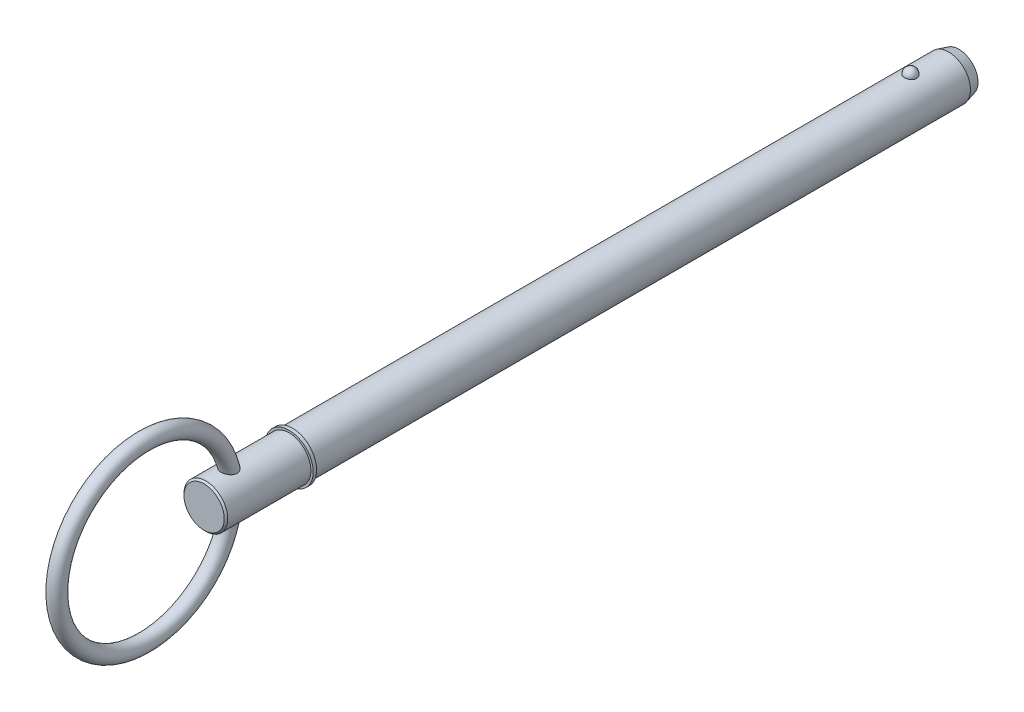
ISO-10303-21;
HEADER;
FILE_DESCRIPTION(('STEP AP214'),'2;1');
FILE_NAME('part.step','',(''),(''),'','','');
FILE_SCHEMA(('AUTOMOTIVE_DESIGN { 1 0 10303 214 1 1 1 1 }'));
ENDSEC;
DATA;
#1=APPLICATION_CONTEXT('core data for automotive mechanical design processes');
#2=APPLICATION_PROTOCOL_DEFINITION('international standard','automotive_design',2000,#1);
#3=PRODUCT_CONTEXT('',#1,'mechanical');
#4=PRODUCT('Part','Part','',(#3));
#5=PRODUCT_RELATED_PRODUCT_CATEGORY('part','',(#4));
#6=PRODUCT_DEFINITION_FORMATION('','',#4);
#7=PRODUCT_DEFINITION_CONTEXT('part definition',#1,'design');
#8=PRODUCT_DEFINITION('design','',#6,#7);
#9=PRODUCT_DEFINITION_SHAPE('','',#8);
#10=(LENGTH_UNIT() NAMED_UNIT(*) SI_UNIT(.MILLI.,.METRE.));
#11=(NAMED_UNIT(*) PLANE_ANGLE_UNIT() SI_UNIT($,.RADIAN.));
#12=(NAMED_UNIT(*) SI_UNIT($,.STERADIAN.) SOLID_ANGLE_UNIT());
#13=UNCERTAINTY_MEASURE_WITH_UNIT(LENGTH_MEASURE(1.E-05),#10,'distance_accuracy_value','');
#14=(GEOMETRIC_REPRESENTATION_CONTEXT(3) GLOBAL_UNCERTAINTY_ASSIGNED_CONTEXT((#13)) GLOBAL_UNIT_ASSIGNED_CONTEXT((#10,
#11,#12)) REPRESENTATION_CONTEXT('',''));
#15=CARTESIAN_POINT('',(0.,0.,0.));
#16=DIRECTION('',(0.,0.,1.));
#17=DIRECTION('',(1.,0.,0.));
#18=AXIS2_PLACEMENT_3D('',#15,#16,#17);
#19=CARTESIAN_POINT('',(0.,0.,177.8));
#20=DIRECTION('',(0.,0.,-1.));
#21=DIRECTION('',(-1.,0.,0.));
#22=AXIS2_PLACEMENT_3D('',#19,#20,#21);
#23=CYLINDRICAL_SURFACE('',#22,6.35);
#24=CARTESIAN_POINT('',(1.76243001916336,6.10051968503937,-1.78));
#25=CARTESIAN_POINT('',(1.76242835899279,6.10052111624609,-1.68050311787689));
#26=CARTESIAN_POINT('',(1.75431593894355,6.1028816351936,-1.58098521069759));
#27=CARTESIAN_POINT('',(1.72206027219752,6.11206037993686,-1.38476972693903));
#28=CARTESIAN_POINT('',(1.69791106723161,6.11888026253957,-1.28807321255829));
#29=CARTESIAN_POINT('',(1.63419596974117,6.13620287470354,-1.10029899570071));
#30=CARTESIAN_POINT('',(1.59463684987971,6.14670398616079,-1.00921884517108));
#31=CARTESIAN_POINT('',(1.50108569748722,6.17021534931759,-0.83516140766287));
#32=CARTESIAN_POINT('',(1.44709398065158,6.18322554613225,-0.752183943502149));
#33=CARTESIAN_POINT('',(1.32572431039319,6.21038081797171,-0.596209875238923));
#34=CARTESIAN_POINT('',(1.2582815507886,6.22453118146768,-0.523264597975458));
#35=CARTESIAN_POINT('',(1.11191624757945,6.25233390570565,-0.389855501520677));
#36=CARTESIAN_POINT('',(1.03299369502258,6.26598626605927,-0.329391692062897));
#37=CARTESIAN_POINT('',(0.866022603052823,6.29123226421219,-0.222793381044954));
#38=CARTESIAN_POINT('',(0.778000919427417,6.30283170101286,-0.176618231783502));
#39=CARTESIAN_POINT('',(0.595108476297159,6.32272058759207,-0.0996905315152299));
#40=CARTESIAN_POINT('',(0.500238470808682,6.33101040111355,-0.0689362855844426));
#41=CARTESIAN_POINT('',(0.308164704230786,6.34323464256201,-0.0241595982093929));
#42=CARTESIAN_POINT('',(0.211033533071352,6.34724467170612,-0.00984637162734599));
#43=CARTESIAN_POINT('',(0.0156629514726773,6.3507318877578,0.00262058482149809));
#44=CARTESIAN_POINT('',(-0.0825763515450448,6.35020951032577,0.000775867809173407));
#45=CARTESIAN_POINT('',(-0.275890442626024,6.34473055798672,-0.0188727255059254));
#46=CARTESIAN_POINT('',(-0.370990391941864,6.3398374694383,-0.0364481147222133));
#47=CARTESIAN_POINT('',(-0.556805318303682,6.32622723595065,-0.0867447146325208));
#48=CARTESIAN_POINT('',(-0.64752021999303,6.31751002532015,-0.119466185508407));
#49=CARTESIAN_POINT('',(-0.82260655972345,6.29711353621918,-0.199386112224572));
#50=CARTESIAN_POINT('',(-0.906938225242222,6.28541739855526,-0.246667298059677));
#51=CARTESIAN_POINT('',(-1.06646479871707,6.26032612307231,-0.35436574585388));
#52=CARTESIAN_POINT('',(-1.14165877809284,6.24693081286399,-0.414784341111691));
#53=CARTESIAN_POINT('',(-1.2823514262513,6.21959142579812,-0.548435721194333));
#54=CARTESIAN_POINT('',(-1.34763761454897,6.2056417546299,-0.621891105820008));
#55=CARTESIAN_POINT('',(-1.4651153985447,6.1789624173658,-0.778815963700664));
#56=CARTESIAN_POINT('',(-1.51730606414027,6.16623283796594,-0.862286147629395));
#57=CARTESIAN_POINT('',(-1.60782211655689,6.14325839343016,-1.03799158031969));
#58=CARTESIAN_POINT('',(-1.64598111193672,6.13304379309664,-1.13031660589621));
#59=CARTESIAN_POINT('',(-1.70661885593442,6.11644899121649,-1.32030667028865));
#60=CARTESIAN_POINT('',(-1.72909805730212,6.11006867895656,-1.41797155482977));
#61=CARTESIAN_POINT('',(-1.75775019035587,6.1018881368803,-1.61543246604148));
#62=CARTESIAN_POINT('',(-1.76399136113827,6.10006874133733,-1.71521779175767));
#63=CARTESIAN_POINT('',(-1.76020715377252,6.10116172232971,-1.91445126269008));
#64=CARTESIAN_POINT('',(-1.750182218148,6.10407397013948,-2.01389941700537));
#65=CARTESIAN_POINT('',(-1.71421005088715,6.11427232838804,-2.20912106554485));
#66=CARTESIAN_POINT('',(-1.68834262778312,6.12153651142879,-2.30491043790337));
#67=CARTESIAN_POINT('',(-1.62139543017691,6.1396067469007,-2.49066180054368));
#68=CARTESIAN_POINT('',(-1.5803150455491,6.15041294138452,-2.58062355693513));
#69=CARTESIAN_POINT('',(-1.48369112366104,6.17443456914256,-2.75271428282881));
#70=CARTESIAN_POINT('',(-1.42806998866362,6.18766281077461,-2.83479789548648));
#71=CARTESIAN_POINT('',(-1.30386620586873,6.21501934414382,-2.98832532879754));
#72=CARTESIAN_POINT('',(-1.23528306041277,6.22914767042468,-3.05976874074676));
#73=CARTESIAN_POINT('',(-1.08663999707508,6.25679135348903,-3.19029656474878));
#74=CARTESIAN_POINT('',(-1.00653826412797,6.27030422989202,-3.24933392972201));
#75=CARTESIAN_POINT('',(-0.837212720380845,6.29514770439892,-3.35304657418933));
#76=CARTESIAN_POINT('',(-0.747989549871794,6.30647845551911,-3.39772286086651));
#77=CARTESIAN_POINT('',(-0.564098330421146,6.32556124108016,-3.47096393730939));
#78=CARTESIAN_POINT('',(-0.469512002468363,6.33335611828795,-3.49972259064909));
#79=CARTESIAN_POINT('',(-0.276633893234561,6.34470628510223,-3.54113722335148));
#80=CARTESIAN_POINT('',(-0.17834256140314,6.34826208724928,-3.55379514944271));
#81=CARTESIAN_POINT('',(0.0171660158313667,6.35071525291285,-3.56255473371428));
#82=CARTESIAN_POINT('',(0.114368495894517,6.34969931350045,-3.55896450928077));
#83=CARTESIAN_POINT('',(0.306746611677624,6.34331695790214,-3.53603383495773));
#84=CARTESIAN_POINT('',(0.401922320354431,6.33795069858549,-3.51669395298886));
#85=CARTESIAN_POINT('',(0.587203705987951,6.32347219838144,-3.4629173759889));
#86=CARTESIAN_POINT('',(0.677327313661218,6.31437430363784,-3.42853846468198));
#87=CARTESIAN_POINT('',(0.850462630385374,6.29339543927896,-3.34564128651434));
#88=CARTESIAN_POINT('',(0.933473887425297,6.2815142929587,-3.29712212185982));
#89=CARTESIAN_POINT('',(1.09144542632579,6.25601750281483,-3.18638742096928));
#90=CARTESIAN_POINT('',(1.16626195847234,6.24237795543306,-3.12397237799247));
#91=CARTESIAN_POINT('',(1.30444862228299,6.21497285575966,-2.98755865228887));
#92=CARTESIAN_POINT('',(1.36781676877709,6.20120728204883,-2.91355796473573));
#93=CARTESIAN_POINT('',(1.48252779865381,6.17479923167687,-2.75456133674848));
#94=CARTESIAN_POINT('',(1.53364167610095,6.16218052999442,-2.66939613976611));
#95=CARTESIAN_POINT('',(1.62109397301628,6.13975602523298,-2.49147502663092));
#96=CARTESIAN_POINT('',(1.657437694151,6.12994921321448,-2.39872184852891));
#97=CARTESIAN_POINT('',(1.71127844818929,6.11512175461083,-2.21887622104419));
#98=CARTESIAN_POINT('',(1.73042646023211,6.10968903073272,-2.13230770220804));
#99=CARTESIAN_POINT('',(1.75600284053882,6.10238739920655,-1.95716498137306));
#100=CARTESIAN_POINT('',(1.76243149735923,6.10051841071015,-1.86859082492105));
#101=CARTESIAN_POINT('',(1.76243001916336,6.10051968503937,-1.78));
#102=B_SPLINE_CURVE_WITH_KNOTS('',3,(#24,#25,#26,#27,#28,#29,#30,#31,#32,#33,#34,#35,#36,#37,
#38,#39,#40,#41,#42,#43,#44,#45,#46,#47,#48,#49,#50,#51,#52,#53,#54,#55,#56,#57,#58,#59,#60,#61,
#62,#63,#64,#65,#66,#67,#68,#69,#70,#71,#72,#73,#74,#75,#76,#77,#78,#79,#80,#81,#82,#83,#84,#85,
#86,#87,#88,#89,#90,#91,#92,#93,#94,#95,#96,#97,#98,#99,#100,#101),.UNSPECIFIED.,.T.,.F.,(4,2,2,
2,2,2,2,2,2,2,2,2,2,2,2,2,2,2,2,2,2,2,2,2,2,2,2,2,2,2,2,2,2,2,2,2,2,2,4),(0.,0.298172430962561,
0.596455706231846,0.894608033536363,1.19275383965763,1.49237238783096,1.79199116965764,
2.09074960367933,2.38947519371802,2.68283180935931,2.97616022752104,3.26529599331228,
3.55443672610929,3.84525169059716,4.13609618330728,4.43249276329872,4.72891038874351,
5.02873757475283,5.32855610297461,5.62711261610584,5.92566100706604,6.22271765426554,
6.51978621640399,6.81847366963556,7.11717259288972,7.41698459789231,7.71677557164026,
8.01283014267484,8.30884891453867,8.59927798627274,8.88969658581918,9.17900899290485,
9.46833977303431,9.76212836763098,10.0559678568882,10.3549321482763,10.6537890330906,
10.9192841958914,11.1847733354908),.UNSPECIFIED.);
#103=CARTESIAN_POINT('',(1.76243001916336,6.10051968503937,-1.78));
#104=VERTEX_POINT('',#103);
#105=EDGE_CURVE('E100',#104,#104,#102,.T.);
#106=ORIENTED_EDGE('',*,*,#105,.T.);
#107=EDGE_LOOP('',(#106));
#108=FACE_BOUND('',#107,.T.);
#109=CARTESIAN_POINT('',(0.,0.,-12.8799999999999));
#110=DIRECTION('',(0.,0.,-1.));
#111=DIRECTION('',(-1.,0.,0.));
#112=AXIS2_PLACEMENT_3D('',#109,#110,#111);
#113=CIRCLE('',#112,6.35);
#114=CARTESIAN_POINT('',(-6.35,0.,-12.8799999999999));
#115=VERTEX_POINT('',#114);
#116=EDGE_CURVE('E107',#115,#115,#113,.F.);
#117=ORIENTED_EDGE('',*,*,#116,.T.);
#118=EDGE_LOOP('',(#117));
#119=FACE_BOUND('',#118,.T.);
#120=CARTESIAN_POINT('',(0.,0.,177.8));
#121=DIRECTION('',(0.,0.,1.));
#122=DIRECTION('',(1.,0.,0.));
#123=AXIS2_PLACEMENT_3D('',#120,#121,#122);
#124=CIRCLE('',#123,6.35);
#125=CARTESIAN_POINT('',(6.35,0.,177.8));
#126=VERTEX_POINT('',#125);
#127=EDGE_CURVE('E105',#126,#126,#124,.T.);
#128=ORIENTED_EDGE('',*,*,#127,.F.);
#129=EDGE_LOOP('',(#128));
#130=FACE_BOUND('',#129,.T.);
#131=ADVANCED_FACE('F39',(#108,#119,#130),#23,.T.);
#132=CARTESIAN_POINT('',(0.,0.,-15.88));
#133=DIRECTION('',(0.,0.,-1.));
#134=DIRECTION('',(-1.,0.,0.));
#135=AXIS2_PLACEMENT_3D('',#132,#133,#134);
#136=PLANE('',#135);
#137=CARTESIAN_POINT('',(0.,0.,-15.88));
#138=DIRECTION('',(0.,0.,-1.));
#139=DIRECTION('',(-1.,0.,0.));
#140=AXIS2_PLACEMENT_3D('',#137,#138,#139);
#141=CIRCLE('',#140,5.54615242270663);
#142=CARTESIAN_POINT('',(-5.54615242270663,0.,-15.88));
#143=VERTEX_POINT('',#142);
#144=EDGE_CURVE('E141',#143,#143,#141,.T.);
#145=ORIENTED_EDGE('',*,*,#144,.T.);
#146=EDGE_LOOP('',(#145));
#147=FACE_BOUND('',#146,.T.);
#148=ADVANCED_FACE('F86',(#147),#136,.T.);
#149=CARTESIAN_POINT('',(0.,0.,-15.88));
#150=DIRECTION('',(0.,0.,1.));
#151=DIRECTION('',(1.,0.,0.));
#152=AXIS2_PLACEMENT_3D('',#149,#150,#151);
#153=CONICAL_SURFACE('',#152,5.54615242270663,0.261799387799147);
#154=ORIENTED_EDGE('',*,*,#116,.F.);
#155=EDGE_LOOP('',(#154));
#156=FACE_BOUND('',#155,.T.);
#157=ORIENTED_EDGE('',*,*,#144,.F.);
#158=EDGE_LOOP('',(#157));
#159=FACE_BOUND('',#158,.T.);
#160=ADVANCED_FACE('F92',(#156,#159),#153,.T.);
#161=CARTESIAN_POINT('',(0.,6.35,-1.78));
#162=DIRECTION('',(0.,1.,0.));
#163=DIRECTION('',(0.,0.,-1.));
#164=AXIS2_PLACEMENT_3D('',#161,#162,#163);
#165=SPHERICAL_SURFACE('',#164,1.78);
#166=ORIENTED_EDGE('',*,*,#105,.F.);
#167=EDGE_LOOP('',(#166));
#168=FACE_BOUND('',#167,.T.);
#169=ADVANCED_FACE('F110',(#168),#165,.T.);
#170=CARTESIAN_POINT('',(0.,0.,177.8));
#171=DIRECTION('',(0.,0.,-1.));
#172=DIRECTION('',(-1.,0.,0.));
#173=AXIS2_PLACEMENT_3D('',#170,#171,#172);
#174=PLANE('',#173);
#175=ORIENTED_EDGE('',*,*,#127,.T.);
#176=EDGE_LOOP('',(#175));
#177=FACE_BOUND('',#176,.T.);
#178=CARTESIAN_POINT('',(0.,0.,177.8));
#179=DIRECTION('',(0.,0.,-1.));
#180=DIRECTION('',(-1.,0.,0.));
#181=AXIS2_PLACEMENT_3D('',#178,#179,#180);
#182=CIRCLE('',#181,7.);
#183=CARTESIAN_POINT('',(-7.,0.,177.8));
#184=VERTEX_POINT('',#183);
#185=EDGE_CURVE('E106',#184,#184,#182,.T.);
#186=ORIENTED_EDGE('',*,*,#185,.T.);
#187=EDGE_LOOP('',(#186));
#188=FACE_BOUND('',#187,.T.);
#189=ADVANCED_FACE('F114',(#177,#188),#174,.T.);
#190=CARTESIAN_POINT('',(0.,0.,33.7287874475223));
#191=DIRECTION('',(0.,0.,-1.));
#192=DIRECTION('',(-1.,0.,0.));
#193=AXIS2_PLACEMENT_3D('',#190,#191,#192);
#194=CYLINDRICAL_SURFACE('',#193,7.);
#195=CARTESIAN_POINT('',(0.,0.,178.8));
#196=DIRECTION('',(0.,0.,-1.));
#197=DIRECTION('',(-1.,0.,0.));
#198=AXIS2_PLACEMENT_3D('',#195,#196,#197);
#199=CIRCLE('',#198,7.);
#200=CARTESIAN_POINT('',(-7.,0.,178.8));
#201=VERTEX_POINT('',#200);
#202=EDGE_CURVE('E131',#201,#201,#199,.T.);
#203=ORIENTED_EDGE('',*,*,#202,.T.);
#204=EDGE_LOOP('',(#203));
#205=FACE_BOUND('',#204,.T.);
#206=ORIENTED_EDGE('',*,*,#185,.F.);
#207=EDGE_LOOP('',(#206));
#208=FACE_BOUND('',#207,.T.);
#209=ADVANCED_FACE('F118',(#205,#208),#194,.T.);
#210=CARTESIAN_POINT('',(0.,7.,178.8));
#211=DIRECTION('',(0.,0.,1.));
#212=DIRECTION('',(1.,0.,0.));
#213=AXIS2_PLACEMENT_3D('',#210,#211,#212);
#214=PLANE('',#213);
#215=CARTESIAN_POINT('',(0.,0.,178.8));
#216=DIRECTION('',(0.,0.,1.));
#217=DIRECTION('',(1.,0.,0.));
#218=AXIS2_PLACEMENT_3D('',#215,#216,#217);
#219=CIRCLE('',#218,6.35);
#220=CARTESIAN_POINT('',(6.35,0.,178.8));
#221=VERTEX_POINT('',#220);
#222=EDGE_CURVE('E109',#221,#221,#219,.T.);
#223=ORIENTED_EDGE('',*,*,#222,.F.);
#224=EDGE_LOOP('',(#223));
#225=FACE_BOUND('',#224,.T.);
#226=ORIENTED_EDGE('',*,*,#202,.F.);
#227=EDGE_LOOP('',(#226));
#228=FACE_BOUND('',#227,.T.);
#229=ADVANCED_FACE('F83',(#225,#228),#214,.T.);
#230=CARTESIAN_POINT('',(0.,0.,203.5));
#231=DIRECTION('',(0.,0.,-1.));
#232=DIRECTION('',(-1.,0.,0.));
#233=AXIS2_PLACEMENT_3D('',#230,#231,#232);
#234=CYLINDRICAL_SURFACE('',#233,6.35);
#235=CARTESIAN_POINT('',(-1.08120660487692,-6.25727514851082,194.25158117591));
#236=CARTESIAN_POINT('',(-0.970724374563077,-6.27636409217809,194.193879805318));
#237=CARTESIAN_POINT('',(-0.855136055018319,-6.29329984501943,194.145219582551));
#238=CARTESIAN_POINT('',(-0.616958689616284,-6.32109419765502,194.06705594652));
#239=CARTESIAN_POINT('',(-0.494369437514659,-6.3319526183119,194.03755309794));
#240=CARTESIAN_POINT('',(-0.245606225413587,-6.34647141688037,193.998367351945));
#241=CARTESIAN_POINT('',(-0.119431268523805,-6.35012977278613,193.988690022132));
#242=CARTESIAN_POINT('',(0.132849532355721,-6.34986313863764,193.989400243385));
#243=CARTESIAN_POINT('',(0.258955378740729,-6.34593843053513,193.999787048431));
#244=CARTESIAN_POINT('',(0.506912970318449,-6.33094785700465,194.040285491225));
#245=CARTESIAN_POINT('',(0.628781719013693,-6.31991516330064,194.070305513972));
#246=CARTESIAN_POINT('',(0.865486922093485,-6.29187143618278,194.149308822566));
#247=CARTESIAN_POINT('',(0.980322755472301,-6.27485987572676,194.198293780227));
#248=CARTESIAN_POINT('',(1.20050616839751,-6.23649440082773,194.314540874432));
#249=CARTESIAN_POINT('',(1.30578867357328,-6.2151135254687,194.381917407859));
#250=CARTESIAN_POINT('',(1.50311440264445,-6.17036440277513,194.533359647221));
#251=CARTESIAN_POINT('',(1.5951571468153,-6.14699608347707,194.617425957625));
#252=CARTESIAN_POINT('',(1.76326863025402,-6.10090072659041,194.800247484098));
#253=CARTESIAN_POINT('',(1.83935482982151,-6.07817301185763,194.898986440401));
#254=CARTESIAN_POINT('',(1.97338559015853,-6.03599268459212,195.108703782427));
#255=CARTESIAN_POINT('',(2.03133638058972,-6.01653894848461,195.219677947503));
#256=CARTESIAN_POINT('',(2.1259120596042,-5.98376466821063,195.447018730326));
#257=CARTESIAN_POINT('',(2.16315310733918,-5.97026970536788,195.563104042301));
#258=CARTESIAN_POINT('',(2.21830650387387,-5.94999923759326,195.800318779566));
#259=CARTESIAN_POINT('',(2.2362211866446,-5.94322292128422,195.921447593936));
#260=CARTESIAN_POINT('',(2.25273772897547,-5.93698111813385,196.163281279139));
#261=CARTESIAN_POINT('',(2.25163224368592,-5.93740484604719,196.283964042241));
#262=CARTESIAN_POINT('',(2.23167546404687,-5.94493297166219,196.523620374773));
#263=CARTESIAN_POINT('',(2.21281883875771,-5.9520393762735,196.642593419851));
#264=CARTESIAN_POINT('',(2.15679576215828,-5.97257680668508,196.883836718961));
#265=CARTESIAN_POINT('',(2.1185113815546,-5.98639144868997,197.00581287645));
#266=CARTESIAN_POINT('',(2.02470263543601,-6.01876484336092,197.242284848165));
#267=CARTESIAN_POINT('',(1.96916879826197,-6.03732620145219,197.356776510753));
#268=CARTESIAN_POINT('',(1.83526629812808,-6.07945247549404,197.587995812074));
#269=CARTESIAN_POINT('',(1.75507038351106,-6.10334207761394,197.703611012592));
#270=CARTESIAN_POINT('',(1.5765788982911,-6.15186551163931,197.919894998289));
#271=CARTESIAN_POINT('',(1.47827192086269,-6.17649980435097,198.020554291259));
#272=CARTESIAN_POINT('',(1.26306696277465,-6.22410762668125,198.205023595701));
#273=CARTESIAN_POINT('',(1.14585214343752,-6.2470408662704,198.288478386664));
#274=CARTESIAN_POINT('',(0.896825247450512,-6.28760987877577,198.431400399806));
#275=CARTESIAN_POINT('',(0.765036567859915,-6.30525397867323,198.490905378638));
#276=CARTESIAN_POINT('',(0.509454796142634,-6.330648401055,198.575263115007));
#277=CARTESIAN_POINT('',(0.386964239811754,-6.33940909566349,198.603695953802));
#278=CARTESIAN_POINT('',(0.200813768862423,-6.3471308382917,198.628680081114));
#279=CARTESIAN_POINT('',(0.138353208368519,-6.34880140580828,198.634063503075));
#280=CARTESIAN_POINT('',(0.0131841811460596,-6.35029448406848,198.63887386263));
#281=CARTESIAN_POINT('',(-0.049524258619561,-6.35011719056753,198.638301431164));
#282=CARTESIAN_POINT('',(-0.219860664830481,-6.34710452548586,198.628597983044));
#283=CARTESIAN_POINT('',(-0.327176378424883,-6.34243953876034,198.613576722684));
#284=CARTESIAN_POINT('',(-0.537619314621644,-6.32808248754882,198.566673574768));
#285=CARTESIAN_POINT('',(-0.640746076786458,-6.31838987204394,198.534789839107));
#286=CARTESIAN_POINT('',(-0.84179516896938,-6.29478075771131,198.455337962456));
#287=CARTESIAN_POINT('',(-0.939631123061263,-6.28081033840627,198.40756888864));
#288=CARTESIAN_POINT('',(-1.12690564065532,-6.2499288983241,198.298513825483));
#289=CARTESIAN_POINT('',(-1.21634109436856,-6.2330167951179,198.237222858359));
#290=CARTESIAN_POINT('',(-1.39713031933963,-6.19517308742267,198.094039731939));
#291=CARTESIAN_POINT('',(-1.48711596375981,-6.17400700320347,198.010483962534));
#292=CARTESIAN_POINT('',(-1.65373642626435,-6.13148145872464,197.830996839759));
#293=CARTESIAN_POINT('',(-1.73036130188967,-6.11012186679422,197.73505636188));
#294=CARTESIAN_POINT('',(-1.87908981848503,-6.0661652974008,197.518620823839));
#295=CARTESIAN_POINT('',(-1.94902044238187,-6.04382072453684,197.396572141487));
#296=CARTESIAN_POINT('',(-2.06849605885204,-6.00398244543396,197.142070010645));
#297=CARTESIAN_POINT('',(-2.11803457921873,-5.98649027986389,197.009613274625));
#298=CARTESIAN_POINT('',(-2.19551930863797,-5.95851933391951,196.734593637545));
#299=CARTESIAN_POINT('',(-2.22297667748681,-5.94819998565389,196.591874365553));
#300=CARTESIAN_POINT('',(-2.25222139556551,-5.93719450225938,196.303480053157));
#301=CARTESIAN_POINT('',(-2.25403508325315,-5.93649848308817,196.157808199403));
#302=CARTESIAN_POINT('',(-2.23178480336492,-5.94489150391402,195.883804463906));
#303=CARTESIAN_POINT('',(-2.21035650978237,-5.95298402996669,195.755226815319));
#304=CARTESIAN_POINT('',(-2.14565882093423,-5.97660650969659,195.50440891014));
#305=CARTESIAN_POINT('',(-2.10239634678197,-5.99213410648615,195.382166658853));
#306=CARTESIAN_POINT('',(-1.99913159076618,-6.02732890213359,195.156747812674));
#307=CARTESIAN_POINT('',(-1.94060271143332,-6.0466053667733,195.052829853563));
#308=CARTESIAN_POINT('',(-1.80736340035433,-6.0877569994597,194.856534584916));
#309=CARTESIAN_POINT('',(-1.73265259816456,-6.10963222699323,194.764157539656));
#310=CARTESIAN_POINT('',(-1.56865095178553,-6.15378470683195,194.592603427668));
#311=CARTESIAN_POINT('',(-1.47928749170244,-6.17606344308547,194.513496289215));
#312=CARTESIAN_POINT('',(-1.28858731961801,-6.21864788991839,194.370675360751));
#313=CARTESIAN_POINT('',(-1.18724893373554,-6.23895332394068,194.306963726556));
#314=CARTESIAN_POINT('',(-1.08120660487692,-6.25727514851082,194.25158117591));
#315=B_SPLINE_CURVE_WITH_KNOTS('',3,(#235,#236,#237,#238,#239,#240,#241,#242,#243,#244,#245,
#246,#247,#248,#249,#250,#251,#252,#253,#254,#255,#256,#257,#258,#259,#260,#261,#262,#263,#264,
#265,#266,#267,#268,#269,#270,#271,#272,#273,#274,#275,#276,#277,#278,#279,#280,#281,#282,#283,
#284,#285,#286,#287,#288,#289,#290,#291,#292,#293,#294,#295,#296,#297,#298,#299,#300,#301,#302,
#303,#304,#305,#306,#307,#308,#309,#310,#311,#312,#313,#314),.UNSPECIFIED.,.T.,.F.,(4,2,2,2,2,2,
2,2,2,2,2,2,2,2,2,2,2,2,2,2,2,2,2,2,2,2,2,2,2,2,2,2,2,2,2,2,2,2,2,4),(0.,0.377861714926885,
0.755734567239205,1.13371352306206,1.51167842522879,1.88789208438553,2.26413891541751,
2.64278156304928,3.02143792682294,3.3996777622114,3.77778752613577,4.14394628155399,
4.51006081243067,4.87054720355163,5.23114188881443,5.61534494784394,5.99975934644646,
6.42600522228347,6.8525204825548,7.28711365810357,7.72101899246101,8.09666132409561,
8.28452949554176,8.47237776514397,8.7960795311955,9.11981678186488,9.44781545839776,
9.77593508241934,10.1483085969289,10.5209580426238,10.9463240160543,11.3718248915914,
11.8065046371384,12.240737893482,12.6304236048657,13.0199858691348,13.3807583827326,
13.7415391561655,14.104165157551,14.4668419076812),.UNSPECIFIED.);
#316=CARTESIAN_POINT('',(-1.08120660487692,-6.25727514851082,194.25158117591));
#317=VERTEX_POINT('',#316);
#318=EDGE_CURVE('E10',#317,#317,#315,.T.);
#319=ORIENTED_EDGE('',*,*,#318,.F.);
#320=EDGE_LOOP('',(#319));
#321=FACE_BOUND('',#320,.T.);
#322=CARTESIAN_POINT('',(-1.08120660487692,6.25727514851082,194.25158117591));
#323=CARTESIAN_POINT('',(-1.19093168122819,6.23831652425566,194.308887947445));
#324=CARTESIAN_POINT('',(-1.29562751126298,6.21723224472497,194.375116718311));
#325=CARTESIAN_POINT('',(-1.49211272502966,6.17302620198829,194.524020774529));
#326=CARTESIAN_POINT('',(-1.58390200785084,6.14990442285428,194.606696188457));
#327=CARTESIAN_POINT('',(-1.75209695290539,6.10411985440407,194.786777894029));
#328=CARTESIAN_POINT('',(-1.82848346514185,6.08145766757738,194.884202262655));
#329=CARTESIAN_POINT('',(-1.96346259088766,6.0392331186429,195.091273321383));
#330=CARTESIAN_POINT('',(-2.02206050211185,6.01966983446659,195.200916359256));
#331=CARTESIAN_POINT('',(-2.11860444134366,5.9863659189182,195.426564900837));
#332=CARTESIAN_POINT('',(-2.15701637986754,5.97249571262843,195.542351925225));
#333=CARTESIAN_POINT('',(-2.21449304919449,5.95142584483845,195.779191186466));
#334=CARTESIAN_POINT('',(-2.23356015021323,5.94422536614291,195.900242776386));
#335=CARTESIAN_POINT('',(-2.25228141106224,5.93715610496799,196.141944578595));
#336=CARTESIAN_POINT('',(-2.25225786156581,5.93716560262,196.262567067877));
#337=CARTESIAN_POINT('',(-2.2344206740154,5.94389982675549,196.502277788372));
#338=CARTESIAN_POINT('',(-2.21660184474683,5.95062651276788,196.621365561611));
#339=CARTESIAN_POINT('',(-2.16272689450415,5.97042554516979,196.862705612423));
#340=CARTESIAN_POINT('',(-2.12559286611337,5.98387086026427,196.984684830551));
#341=CARTESIAN_POINT('',(-2.03409944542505,6.01558578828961,197.221342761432));
#342=CARTESIAN_POINT('',(-1.97973080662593,6.03385799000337,197.336017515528));
#343=CARTESIAN_POINT('',(-1.84828023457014,6.07549301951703,197.567865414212));
#344=CARTESIAN_POINT('',(-1.76936622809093,6.09919386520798,197.683943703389));
#345=CARTESIAN_POINT('',(-1.59344783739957,6.14749881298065,197.901420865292));
#346=CARTESIAN_POINT('',(-1.49643151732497,6.17210350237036,198.002809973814));
#347=CARTESIAN_POINT('',(-1.28333318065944,6.21994692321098,198.189508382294));
#348=CARTESIAN_POINT('',(-1.1668572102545,6.24314005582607,198.2743845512));
#349=CARTESIAN_POINT('',(-0.919062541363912,6.2843871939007,198.42034404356));
#350=CARTESIAN_POINT('',(-0.78776676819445,6.30244898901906,198.481463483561));
#351=CARTESIAN_POINT('',(-0.532335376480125,6.32876911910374,198.56911129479));
#352=CARTESIAN_POINT('',(-0.40951692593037,6.33800211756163,198.599123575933));
#353=CARTESIAN_POINT('',(-0.222636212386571,6.34640533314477,198.626338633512));
#354=CARTESIAN_POINT('',(-0.159893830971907,6.34829860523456,198.632442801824));
#355=CARTESIAN_POINT('',(-0.0340877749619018,6.35021985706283,198.63863417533));
#356=CARTESIAN_POINT('',(0.0289758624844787,6.35024804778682,198.63872206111));
#357=CARTESIAN_POINT('',(0.200008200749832,6.34776620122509,198.630732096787));
#358=CARTESIAN_POINT('',(0.307730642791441,6.34342046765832,198.61675007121));
#359=CARTESIAN_POINT('',(0.51913450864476,6.32963338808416,198.571765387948));
#360=CARTESIAN_POINT('',(0.622815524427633,6.3201915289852,198.540761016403));
#361=CARTESIAN_POINT('',(0.824580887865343,6.2970603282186,198.463086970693));
#362=CARTESIAN_POINT('',(0.922611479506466,6.28333629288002,198.416289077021));
#363=CARTESIAN_POINT('',(1.11039970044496,6.2528858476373,198.309122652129));
#364=CARTESIAN_POINT('',(1.20015435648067,6.23615836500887,198.248749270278));
#365=CARTESIAN_POINT('',(1.38155818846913,6.19866747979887,198.10760245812));
#366=CARTESIAN_POINT('',(1.4718764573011,6.17766310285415,198.025184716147));
#367=CARTESIAN_POINT('',(1.63933626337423,6.13535258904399,197.847946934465));
#368=CARTESIAN_POINT('',(1.71646809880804,6.11404624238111,197.753117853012));
#369=CARTESIAN_POINT('',(1.86660460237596,6.07002946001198,197.538851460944));
#370=CARTESIAN_POINT('',(1.93743710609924,6.04755477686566,197.417834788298));
#371=CARTESIAN_POINT('',(2.05894300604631,6.00727604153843,197.165280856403));
#372=CARTESIAN_POINT('',(2.10960917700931,5.98947366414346,197.033739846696));
#373=CARTESIAN_POINT('',(2.18982014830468,5.96062717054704,196.759758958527));
#374=CARTESIAN_POINT('',(2.21877575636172,5.94977267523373,196.617123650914));
#375=CARTESIAN_POINT('',(2.25104759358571,5.93764416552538,196.328595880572));
#376=CARTESIAN_POINT('',(2.25438985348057,5.93636042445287,196.182706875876));
#377=CARTESIAN_POINT('',(2.23498011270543,5.94368858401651,195.907731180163));
#378=CARTESIAN_POINT('',(2.21482640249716,5.95131530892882,195.778434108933));
#379=CARTESIAN_POINT('',(2.15248760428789,5.97414352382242,195.525969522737));
#380=CARTESIAN_POINT('',(2.11031020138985,5.98934237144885,195.402799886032));
#381=CARTESIAN_POINT('',(2.00904610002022,6.02402214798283,195.175783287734));
#382=CARTESIAN_POINT('',(1.95150192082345,6.04308594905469,195.071178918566));
#383=CARTESIAN_POINT('',(1.82009972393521,6.08395083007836,194.873382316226));
#384=CARTESIAN_POINT('',(1.74624088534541,6.10575204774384,194.780190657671));
#385=CARTESIAN_POINT('',(1.58309476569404,6.15008431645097,194.606164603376));
#386=CARTESIAN_POINT('',(1.49360904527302,6.17262128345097,194.525518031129));
#387=CARTESIAN_POINT('',(1.30231515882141,6.21579297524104,194.379836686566));
#388=CARTESIAN_POINT('',(1.20050521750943,6.23642742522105,194.31480416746));
#389=CARTESIAN_POINT('',(0.983786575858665,6.27432316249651,194.1998596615));
#390=CARTESIAN_POINT('',(0.868563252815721,6.29145558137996,194.150497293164));
#391=CARTESIAN_POINT('',(0.630994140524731,6.31970327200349,194.070885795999));
#392=CARTESIAN_POINT('',(0.508648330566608,6.33081852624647,194.040636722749));
#393=CARTESIAN_POINT('',(0.259933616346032,6.34590352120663,193.999879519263));
#394=CARTESIAN_POINT('',(0.133554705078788,6.34985380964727,193.989425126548));
#395=CARTESIAN_POINT('',(-0.119270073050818,6.35013815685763,193.988667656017));
#396=CARTESIAN_POINT('',(-0.245715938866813,6.34647233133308,193.998364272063));
#397=CARTESIAN_POINT('',(-0.494670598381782,6.33192772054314,194.037620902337));
#398=CARTESIAN_POINT('',(-0.617189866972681,6.3210701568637,194.067122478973));
#399=CARTESIAN_POINT('',(-0.855240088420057,6.29328476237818,194.145263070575));
#400=CARTESIAN_POINT('',(-0.970770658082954,6.27635659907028,194.193903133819));
#401=CARTESIAN_POINT('',(-1.08120660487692,6.25727514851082,194.25158117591));
#402=B_SPLINE_CURVE_WITH_KNOTS('',3,(#322,#323,#324,#325,#326,#327,#328,#329,#330,#331,#332,
#333,#334,#335,#336,#337,#338,#339,#340,#341,#342,#343,#344,#345,#346,#347,#348,#349,#350,#351,
#352,#353,#354,#355,#356,#357,#358,#359,#360,#361,#362,#363,#364,#365,#366,#367,#368,#369,#370,
#371,#372,#373,#374,#375,#376,#377,#378,#379,#380,#381,#382,#383,#384,#385,#386,#387,#388,#389,
#390,#391,#392,#393,#394,#395,#396,#397,#398,#399,#400,#401),.UNSPECIFIED.,.T.,.F.,(4,2,2,2,2,2,
2,2,2,2,2,2,2,2,2,2,2,2,2,2,2,2,2,2,2,2,2,2,2,2,2,2,2,2,2,2,2,2,2,4),(0.,0.375258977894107,
0.750520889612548,1.1262465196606,1.50186014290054,1.86837438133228,2.23484370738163,
2.59512638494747,2.95551419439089,3.33859924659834,3.7218901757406,4.14704029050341,
4.57247172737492,5.00788576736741,5.44263524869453,5.82040093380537,6.00932292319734,
6.19822354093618,6.52266071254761,6.84713055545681,7.17430063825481,7.50158780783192,
7.87233275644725,8.24334931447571,8.66748794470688,9.09177840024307,9.52720369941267,
9.96218641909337,10.3532895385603,10.7442562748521,11.1052784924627,11.4663188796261,
11.8323306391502,12.1983951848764,12.5761580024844,12.9539219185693,13.3327099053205,
13.7114921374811,14.0891615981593,14.4668517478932),.UNSPECIFIED.);
#403=CARTESIAN_POINT('',(-1.08120660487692,6.25727514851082,194.25158117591));
#404=VERTEX_POINT('',#403);
#405=EDGE_CURVE('E51',#404,#404,#402,.T.);
#406=ORIENTED_EDGE('',*,*,#405,.F.);
#407=EDGE_LOOP('',(#406));
#408=FACE_BOUND('',#407,.T.);
#409=CARTESIAN_POINT('',(0.,0.,203.));
#410=DIRECTION('',(0.,0.,-1.));
#411=DIRECTION('',(-1.,0.,0.));
#412=AXIS2_PLACEMENT_3D('',#409,#410,#411);
#413=CIRCLE('',#412,6.35);
#414=CARTESIAN_POINT('',(-6.35,0.,203.));
#415=VERTEX_POINT('',#414);
#416=EDGE_CURVE('E62',#415,#415,#413,.T.);
#417=ORIENTED_EDGE('',*,*,#416,.T.);
#418=EDGE_LOOP('',(#417));
#419=FACE_BOUND('',#418,.T.);
#420=ORIENTED_EDGE('',*,*,#222,.T.);
#421=EDGE_LOOP('',(#420));
#422=FACE_BOUND('',#421,.T.);
#423=ADVANCED_FACE('F67',(#321,#408,#419,#422),#234,.T.);
#424=CARTESIAN_POINT('',(0.,0.,203.5));
#425=DIRECTION('',(0.,0.,-1.));
#426=DIRECTION('',(-1.,0.,0.));
#427=AXIS2_PLACEMENT_3D('',#424,#425,#426);
#428=PLANE('',#427);
#429=CARTESIAN_POINT('',(0.,0.,203.5));
#430=DIRECTION('',(0.,0.,-1.));
#431=DIRECTION('',(-1.,0.,0.));
#432=AXIS2_PLACEMENT_3D('',#429,#430,#431);
#433=CIRCLE('',#432,5.84999999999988);
#434=CARTESIAN_POINT('',(-5.84999999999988,0.,203.5));
#435=VERTEX_POINT('',#434);
#436=EDGE_CURVE('E57',#435,#435,#433,.F.);
#437=ORIENTED_EDGE('',*,*,#436,.T.);
#438=EDGE_LOOP('',(#437));
#439=FACE_BOUND('',#438,.T.);
#440=ADVANCED_FACE('F74',(#439),#428,.F.);
#441=CARTESIAN_POINT('',(0.,0.,203.));
#442=DIRECTION('',(0.,0.,-1.));
#443=DIRECTION('',(-1.,0.,0.));
#444=AXIS2_PLACEMENT_3D('',#441,#442,#443);
#445=CONICAL_SURFACE('',#444,6.35,0.785398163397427);
#446=ORIENTED_EDGE('',*,*,#436,.F.);
#447=EDGE_LOOP('',(#446));
#448=FACE_BOUND('',#447,.T.);
#449=ORIENTED_EDGE('',*,*,#416,.F.);
#450=EDGE_LOOP('',(#449));
#451=FACE_BOUND('',#450,.T.);
#452=ADVANCED_FACE('F41',(#448,#451),#445,.T.);
#453=CARTESIAN_POINT('',(0.,0.,220.9));
#454=DIRECTION('',(1.,0.,0.));
#455=DIRECTION('',(0.,0.,-1.));
#456=AXIS2_PLACEMENT_3D('',#453,#454,#455);
#457=TOROIDAL_SURFACE('',#456,25.4,2.25);
#458=ORIENTED_EDGE('',*,*,#318,.T.);
#459=EDGE_LOOP('',(#458));
#460=FACE_BOUND('',#459,.T.);
#461=ORIENTED_EDGE('',*,*,#405,.T.);
#462=EDGE_LOOP('',(#461));
#463=FACE_BOUND('',#462,.T.);
#464=ADVANCED_FACE('F71',(#460,#463),#457,.T.);
#465=CLOSED_SHELL('',(#131,#148,#160,#169,#189,#209,#229,#423,#440,#452,#464));
#466=MANIFOLD_SOLID_BREP('B2',#465);
#467=ADVANCED_BREP_SHAPE_REPRESENTATION('',(#18,#466),#14);
#468=SHAPE_DEFINITION_REPRESENTATION(#9,#467);
ENDSEC;
END-ISO-10303-21;
